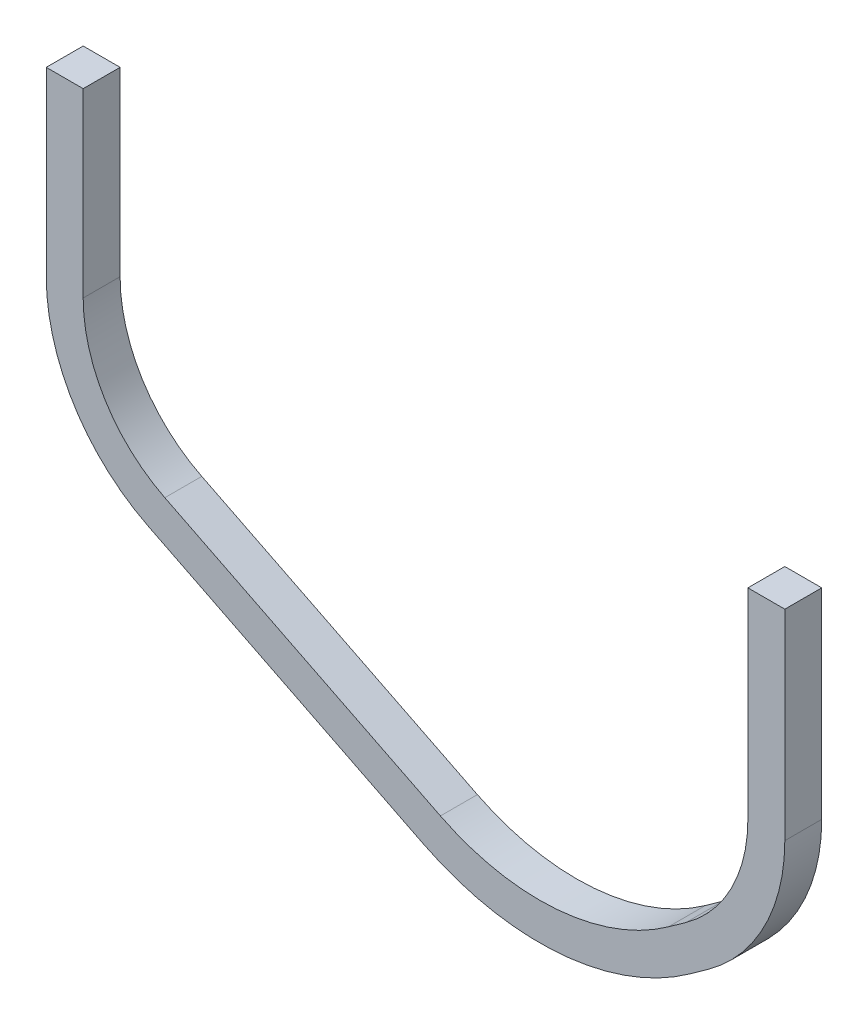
ISO-10303-21;
HEADER;
FILE_DESCRIPTION(('STEP AP214'),'2;1');
FILE_NAME('part.step','',(''),(''),'','','');
FILE_SCHEMA(('AUTOMOTIVE_DESIGN { 1 0 10303 214 1 1 1 1 }'));
ENDSEC;
DATA;
#1=APPLICATION_CONTEXT('core data for automotive mechanical design processes');
#2=APPLICATION_PROTOCOL_DEFINITION('international standard','automotive_design',2000,#1);
#3=PRODUCT_CONTEXT('',#1,'mechanical');
#4=PRODUCT('Part','Part','',(#3));
#5=PRODUCT_RELATED_PRODUCT_CATEGORY('part','',(#4));
#6=PRODUCT_DEFINITION_FORMATION('','',#4);
#7=PRODUCT_DEFINITION_CONTEXT('part definition',#1,'design');
#8=PRODUCT_DEFINITION('design','',#6,#7);
#9=PRODUCT_DEFINITION_SHAPE('','',#8);
#10=(LENGTH_UNIT() NAMED_UNIT(*) SI_UNIT(.MILLI.,.METRE.));
#11=(NAMED_UNIT(*) PLANE_ANGLE_UNIT() SI_UNIT($,.RADIAN.));
#12=(NAMED_UNIT(*) SI_UNIT($,.STERADIAN.) SOLID_ANGLE_UNIT());
#13=UNCERTAINTY_MEASURE_WITH_UNIT(LENGTH_MEASURE(1.E-05),#10,'distance_accuracy_value','');
#14=(GEOMETRIC_REPRESENTATION_CONTEXT(3) GLOBAL_UNCERTAINTY_ASSIGNED_CONTEXT((#13)) GLOBAL_UNIT_ASSIGNED_CONTEXT((#10,
#11,#12)) REPRESENTATION_CONTEXT('',''));
#15=CARTESIAN_POINT('',(0.,0.,0.));
#16=DIRECTION('',(0.,0.,1.));
#17=DIRECTION('',(1.,0.,0.));
#18=AXIS2_PLACEMENT_3D('',#15,#16,#17);
#19=CARTESIAN_POINT('',(-10.,4.00000010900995,0.25));
#20=DIRECTION('',(0.,-1.,0.));
#21=DIRECTION('',(0.,0.,-1.));
#22=AXIS2_PLACEMENT_3D('',#19,#20,#21);
#23=PLANE('',#22);
#24=DIRECTION('',(-1.,0.,0.));
#25=VECTOR('',#24,1.);
#26=CARTESIAN_POINT('',(-10.,4.00000010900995,-0.25));
#27=LINE('',#26,#25);
#28=CARTESIAN_POINT('',(-9.49999999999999,4.00000010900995,-0.25));
#29=VERTEX_POINT('',#28);
#30=CARTESIAN_POINT('',(-10.,4.00000010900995,-0.25));
#31=VERTEX_POINT('',#30);
#32=EDGE_CURVE('E149',#29,#31,#27,.T.);
#33=ORIENTED_EDGE('',*,*,#32,.T.);
#34=DIRECTION('',(0.,0.,-1.));
#35=VECTOR('',#34,1.);
#36=CARTESIAN_POINT('',(-10.,4.00000010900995,0.25));
#37=LINE('',#36,#35);
#38=CARTESIAN_POINT('',(-10.,4.00000010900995,0.25));
#39=VERTEX_POINT('',#38);
#40=EDGE_CURVE('E156',#39,#31,#37,.T.);
#41=ORIENTED_EDGE('',*,*,#40,.F.);
#42=DIRECTION('',(-1.,0.,0.));
#43=VECTOR('',#42,1.);
#44=CARTESIAN_POINT('',(-10.,4.00000010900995,0.25));
#45=LINE('',#44,#43);
#46=CARTESIAN_POINT('',(-9.49999999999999,4.00000010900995,0.25));
#47=VERTEX_POINT('',#46);
#48=EDGE_CURVE('E188',#47,#39,#45,.T.);
#49=ORIENTED_EDGE('',*,*,#48,.F.);
#50=DIRECTION('',(0.,0.,-1.));
#51=VECTOR('',#50,1.);
#52=CARTESIAN_POINT('',(-9.49999999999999,4.00000010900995,0.25));
#53=LINE('',#52,#51);
#54=EDGE_CURVE('E168',#47,#29,#53,.T.);
#55=ORIENTED_EDGE('',*,*,#54,.T.);
#56=EDGE_LOOP('',(#33,#41,#49,#55));
#57=FACE_BOUND('',#56,.T.);
#58=ADVANCED_FACE('F33',(#57),#23,.F.);
#59=CARTESIAN_POINT('',(-10.,4.00000010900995,0.25));
#60=DIRECTION('',(1.,0.,0.));
#61=DIRECTION('',(0.,1.,0.));
#62=AXIS2_PLACEMENT_3D('',#59,#60,#61);
#63=PLANE('',#62);
#64=DIRECTION('',(0.,-1.,0.));
#65=VECTOR('',#64,1.);
#66=CARTESIAN_POINT('',(-10.,4.00000010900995,-0.25));
#67=LINE('',#66,#65);
#68=CARTESIAN_POINT('',(-10.,1.54508505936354,-0.25));
#69=VERTEX_POINT('',#68);
#70=EDGE_CURVE('E144',#31,#69,#67,.T.);
#71=ORIENTED_EDGE('',*,*,#70,.T.);
#72=DIRECTION('',(0.,0.,-1.));
#73=VECTOR('',#72,1.);
#74=CARTESIAN_POINT('',(-10.,1.54508505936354,0.25));
#75=LINE('',#74,#73);
#76=CARTESIAN_POINT('',(-10.,1.54508505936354,0.25));
#77=VERTEX_POINT('',#76);
#78=EDGE_CURVE('E229',#69,#77,#75,.F.);
#79=ORIENTED_EDGE('',*,*,#78,.T.);
#80=DIRECTION('',(0.,-1.,0.));
#81=VECTOR('',#80,1.);
#82=CARTESIAN_POINT('',(-10.,4.00000010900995,0.25));
#83=LINE('',#82,#81);
#84=EDGE_CURVE('E159',#39,#77,#83,.T.);
#85=ORIENTED_EDGE('',*,*,#84,.F.);
#86=ORIENTED_EDGE('',*,*,#40,.T.);
#87=EDGE_LOOP('',(#71,#79,#85,#86));
#88=FACE_BOUND('',#87,.T.);
#89=ADVANCED_FACE('F157',(#88),#63,.F.);
#90=CARTESIAN_POINT('',(-10.,1.09009954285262E-07,0.25));
#91=DIRECTION('',(0.447213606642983,0.894427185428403,0.));
#92=DIRECTION('',(-0.894427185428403,0.447213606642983,0.));
#93=AXIS2_PLACEMENT_3D('',#90,#91,#92);
#94=PLANE('',#93);
#95=DIRECTION('',(0.894427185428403,-0.447213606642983,0.));
#96=VECTOR('',#95,1.);
#97=CARTESIAN_POINT('',(-10.,1.09009954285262E-07,-0.25));
#98=LINE('',#97,#96);
#99=CARTESIAN_POINT('',(-8.61803401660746,-0.690982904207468,-0.25));
#100=VERTEX_POINT('',#99);
#101=CARTESIAN_POINT('',(-4.88657774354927,-2.55671109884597,-0.25));
#102=VERTEX_POINT('',#101);
#103=EDGE_CURVE('E153',#100,#102,#98,.T.);
#104=ORIENTED_EDGE('',*,*,#103,.T.);
#105=DIRECTION('',(0.,0.,-1.));
#106=VECTOR('',#105,1.);
#107=CARTESIAN_POINT('',(-4.88657774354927,-2.55671109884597,0.25));
#108=LINE('',#107,#106);
#109=CARTESIAN_POINT('',(-4.88657774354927,-2.55671109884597,0.25));
#110=VERTEX_POINT('',#109);
#111=EDGE_CURVE('E40',#102,#110,#108,.F.);
#112=ORIENTED_EDGE('',*,*,#111,.T.);
#113=DIRECTION('',(0.894427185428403,-0.447213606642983,0.));
#114=VECTOR('',#113,1.);
#115=CARTESIAN_POINT('',(-10.,1.09009954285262E-07,0.25));
#116=LINE('',#115,#114);
#117=CARTESIAN_POINT('',(-8.61803401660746,-0.690982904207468,0.25));
#118=VERTEX_POINT('',#117);
#119=EDGE_CURVE('E191',#118,#110,#116,.T.);
#120=ORIENTED_EDGE('',*,*,#119,.F.);
#121=DIRECTION('',(0.,0.,-1.));
#122=VECTOR('',#121,1.);
#123=CARTESIAN_POINT('',(-8.61803401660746,-0.690982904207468,0.25));
#124=LINE('',#123,#122);
#125=EDGE_CURVE('E225',#118,#100,#124,.T.);
#126=ORIENTED_EDGE('',*,*,#125,.T.);
#127=EDGE_LOOP('',(#104,#112,#120,#126));
#128=FACE_BOUND('',#127,.T.);
#129=ADVANCED_FACE('F331',(#128),#94,.F.);
#130=CARTESIAN_POINT('',(-3.,-3.5,0.25));
#131=DIRECTION('',(-0.581911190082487,0.81325233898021,0.));
#132=DIRECTION('',(-0.81325233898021,-0.581911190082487,0.));
#133=AXIS2_PLACEMENT_3D('',#130,#131,#132);
#134=PLANE('',#133);
#135=DIRECTION('',(0.81325233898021,0.581911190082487,0.));
#136=VECTOR('',#135,1.);
#137=CARTESIAN_POINT('',(-3.,-3.5,0.25));
#138=LINE('',#137,#136);
#139=CARTESIAN_POINT('',(-1.28464095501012,-2.2725991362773,0.25));
#140=VERTEX_POINT('',#139);
#141=CARTESIAN_POINT('',(-1.04522202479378,-2.10128631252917,0.25));
#142=VERTEX_POINT('',#141);
#143=EDGE_CURVE('E193',#140,#142,#138,.T.);
#144=ORIENTED_EDGE('',*,*,#143,.F.);
#145=DIRECTION('',(0.,0.,-1.));
#146=VECTOR('',#145,1.);
#147=CARTESIAN_POINT('',(-1.28464095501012,-2.2725991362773,0.25));
#148=LINE('',#147,#146);
#149=CARTESIAN_POINT('',(-1.28464095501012,-2.2725991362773,-0.25));
#150=VERTEX_POINT('',#149);
#151=EDGE_CURVE('E262',#140,#150,#148,.T.);
#152=ORIENTED_EDGE('',*,*,#151,.T.);
#153=DIRECTION('',(0.81325233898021,0.581911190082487,0.));
#154=VECTOR('',#153,1.);
#155=CARTESIAN_POINT('',(-3.,-3.5,-0.25));
#156=LINE('',#155,#154);
#157=CARTESIAN_POINT('',(-1.04522202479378,-2.10128631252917,-0.25));
#158=VERTEX_POINT('',#157);
#159=EDGE_CURVE('E172',#150,#158,#156,.T.);
#160=ORIENTED_EDGE('',*,*,#159,.T.);
#161=DIRECTION('',(0.,0.,-1.));
#162=VECTOR('',#161,1.);
#163=CARTESIAN_POINT('',(-1.04522202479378,-2.10128631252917,0.25));
#164=LINE('',#163,#162);
#165=EDGE_CURVE('E239',#158,#142,#164,.F.);
#166=ORIENTED_EDGE('',*,*,#165,.T.);
#167=EDGE_LOOP('',(#144,#152,#160,#166));
#168=FACE_BOUND('',#167,.T.);
#169=ADVANCED_FACE('F268',(#168),#134,.F.);
#170=CARTESIAN_POINT('',(0.,-1.3533925,0.25));
#171=DIRECTION('',(-1.,0.,0.));
#172=DIRECTION('',(0.,0.,1.));
#173=AXIS2_PLACEMENT_3D('',#170,#171,#172);
#174=PLANE('',#173);
#175=DIRECTION('',(0.,1.,0.));
#176=VECTOR('',#175,1.);
#177=CARTESIAN_POINT('',(0.,-1.3533925,0.25));
#178=LINE('',#177,#176);
#179=CARTESIAN_POINT('',(0.,-0.0681554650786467,0.25));
#180=VERTEX_POINT('',#179);
#181=CARTESIAN_POINT('',(0.,2.6466075,0.25));
#182=VERTEX_POINT('',#181);
#183=EDGE_CURVE('E195',#180,#182,#178,.T.);
#184=ORIENTED_EDGE('',*,*,#183,.F.);
#185=DIRECTION('',(0.,0.,-1.));
#186=VECTOR('',#185,1.);
#187=CARTESIAN_POINT('',(0.,-0.0681554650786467,0.25));
#188=LINE('',#187,#186);
#189=CARTESIAN_POINT('',(0.,-0.0681554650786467,-0.25));
#190=VERTEX_POINT('',#189);
#191=EDGE_CURVE('E233',#180,#190,#188,.T.);
#192=ORIENTED_EDGE('',*,*,#191,.T.);
#193=DIRECTION('',(0.,1.,0.));
#194=VECTOR('',#193,1.);
#195=CARTESIAN_POINT('',(0.,-1.3533925,-0.25));
#196=LINE('',#195,#194);
#197=CARTESIAN_POINT('',(0.,2.6466075,-0.25));
#198=VERTEX_POINT('',#197);
#199=EDGE_CURVE('E174',#190,#198,#196,.T.);
#200=ORIENTED_EDGE('',*,*,#199,.T.);
#201=DIRECTION('',(0.,0.,-1.));
#202=VECTOR('',#201,1.);
#203=CARTESIAN_POINT('',(0.,2.6466075,0.25));
#204=LINE('',#203,#202);
#205=EDGE_CURVE('E164',#182,#198,#204,.T.);
#206=ORIENTED_EDGE('',*,*,#205,.F.);
#207=EDGE_LOOP('',(#184,#192,#200,#206));
#208=FACE_BOUND('',#207,.T.);
#209=ADVANCED_FACE('F283',(#208),#174,.F.);
#210=CARTESIAN_POINT('',(-0.5,2.6466075,0.25));
#211=DIRECTION('',(0.,-1.,0.));
#212=DIRECTION('',(1.,0.,0.));
#213=AXIS2_PLACEMENT_3D('',#210,#211,#212);
#214=PLANE('',#213);
#215=DIRECTION('',(-1.,0.,0.));
#216=VECTOR('',#215,1.);
#217=CARTESIAN_POINT('',(-0.5,2.6466075,-0.25));
#218=LINE('',#217,#216);
#219=CARTESIAN_POINT('',(-0.5,2.6466075,-0.25));
#220=VERTEX_POINT('',#219);
#221=EDGE_CURVE('E176',#198,#220,#218,.T.);
#222=ORIENTED_EDGE('',*,*,#221,.T.);
#223=DIRECTION('',(0.,0.,-1.));
#224=VECTOR('',#223,1.);
#225=CARTESIAN_POINT('',(-0.5,2.6466075,0.25));
#226=LINE('',#225,#224);
#227=CARTESIAN_POINT('',(-0.5,2.6466075,0.25));
#228=VERTEX_POINT('',#227);
#229=EDGE_CURVE('E210',#228,#220,#226,.T.);
#230=ORIENTED_EDGE('',*,*,#229,.F.);
#231=DIRECTION('',(-1.,0.,0.));
#232=VECTOR('',#231,1.);
#233=CARTESIAN_POINT('',(-0.5,2.6466075,0.25));
#234=LINE('',#233,#232);
#235=EDGE_CURVE('E197',#182,#228,#234,.T.);
#236=ORIENTED_EDGE('',*,*,#235,.F.);
#237=ORIENTED_EDGE('',*,*,#205,.T.);
#238=EDGE_LOOP('',(#222,#230,#236,#237));
#239=FACE_BOUND('',#238,.T.);
#240=ADVANCED_FACE('F287',(#239),#214,.F.);
#241=CARTESIAN_POINT('',(-0.5,-1.09634509,0.25));
#242=DIRECTION('',(1.,0.,0.));
#243=DIRECTION('',(0.,0.,-1.));
#244=AXIS2_PLACEMENT_3D('',#241,#242,#243);
#245=PLANE('',#244);
#246=DIRECTION('',(0.,-1.,0.));
#247=VECTOR('',#246,1.);
#248=CARTESIAN_POINT('',(-0.5,-1.09634509,-0.25));
#249=LINE('',#248,#247);
#250=CARTESIAN_POINT('',(-0.5,-0.0681554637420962,-0.25));
#251=VERTEX_POINT('',#250);
#252=EDGE_CURVE('E178',#220,#251,#249,.T.);
#253=ORIENTED_EDGE('',*,*,#252,.T.);
#254=DIRECTION('',(0.,0.,-1.));
#255=VECTOR('',#254,1.);
#256=CARTESIAN_POINT('',(-0.5,-0.0681554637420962,0.25));
#257=LINE('',#256,#255);
#258=CARTESIAN_POINT('',(-0.5,-0.0681554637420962,0.25));
#259=VERTEX_POINT('',#258);
#260=EDGE_CURVE('E247',#251,#259,#257,.F.);
#261=ORIENTED_EDGE('',*,*,#260,.T.);
#262=DIRECTION('',(0.,-1.,0.));
#263=VECTOR('',#262,1.);
#264=CARTESIAN_POINT('',(-0.5,-1.09634509,0.25));
#265=LINE('',#264,#263);
#266=EDGE_CURVE('E199',#228,#259,#265,.T.);
#267=ORIENTED_EDGE('',*,*,#266,.F.);
#268=ORIENTED_EDGE('',*,*,#229,.T.);
#269=EDGE_LOOP('',(#253,#261,#267,#268));
#270=FACE_BOUND('',#269,.T.);
#271=ADVANCED_FACE('F343',(#270),#245,.F.);
#272=CARTESIAN_POINT('',(-3.04590429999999,-2.91803085,0.25));
#273=DIRECTION('',(0.581911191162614,-0.813252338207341,0.));
#274=DIRECTION('',(0.813252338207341,0.581911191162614,0.));
#275=AXIS2_PLACEMENT_3D('',#272,#273,#274);
#276=PLANE('',#275);
#277=DIRECTION('',(-0.813252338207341,-0.581911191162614,0.));
#278=VECTOR('',#277,1.);
#279=CARTESIAN_POINT('',(-3.04590429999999,-2.91803085,-0.25));
#280=LINE('',#279,#278);
#281=CARTESIAN_POINT('',(-1.33617761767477,-1.69466014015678,-0.25));
#282=VERTEX_POINT('',#281);
#283=CARTESIAN_POINT('',(-1.57559654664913,-1.86597296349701,-0.25));
#284=VERTEX_POINT('',#283);
#285=EDGE_CURVE('E181',#282,#284,#280,.T.);
#286=ORIENTED_EDGE('',*,*,#285,.T.);
#287=DIRECTION('',(0.,0.,-1.));
#288=VECTOR('',#287,1.);
#289=CARTESIAN_POINT('',(-1.57559654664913,-1.86597296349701,0.25));
#290=LINE('',#289,#288);
#291=CARTESIAN_POINT('',(-1.57559654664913,-1.86597296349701,0.25));
#292=VERTEX_POINT('',#291);
#293=EDGE_CURVE('E256',#284,#292,#290,.F.);
#294=ORIENTED_EDGE('',*,*,#293,.T.);
#295=DIRECTION('',(-0.813252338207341,-0.581911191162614,0.));
#296=VECTOR('',#295,1.);
#297=CARTESIAN_POINT('',(-3.04590429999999,-2.91803085,0.25));
#298=LINE('',#297,#296);
#299=CARTESIAN_POINT('',(-1.33617761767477,-1.69466014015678,0.25));
#300=VERTEX_POINT('',#299);
#301=EDGE_CURVE('E202',#300,#292,#298,.T.);
#302=ORIENTED_EDGE('',*,*,#301,.F.);
#303=DIRECTION('',(0.,0.,-1.));
#304=VECTOR('',#303,1.);
#305=CARTESIAN_POINT('',(-1.33617761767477,-1.69466014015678,-0.25));
#306=LINE('',#305,#304);
#307=EDGE_CURVE('E244',#300,#282,#306,.T.);
#308=ORIENTED_EDGE('',*,*,#307,.T.);
#309=EDGE_LOOP('',(#286,#294,#302,#308));
#310=FACE_BOUND('',#309,.T.);
#311=ADVANCED_FACE('F298',(#310),#276,.F.);
#312=CARTESIAN_POINT('',(-9.49999999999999,0.309017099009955,0.25));
#313=DIRECTION('',(-0.447213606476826,-0.894427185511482,0.));
#314=DIRECTION('',(0.894427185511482,-0.447213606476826,0.));
#315=AXIS2_PLACEMENT_3D('',#312,#313,#314);
#316=PLANE('',#315);
#317=DIRECTION('',(-0.894427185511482,0.447213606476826,0.));
#318=VECTOR('',#317,1.);
#319=CARTESIAN_POINT('',(-9.49999999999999,0.309017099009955,0.25));
#320=LINE('',#319,#318);
#321=CARTESIAN_POINT('',(-4.66297093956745,-2.10949750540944,0.25));
#322=VERTEX_POINT('',#321);
#323=CARTESIAN_POINT('',(-8.39442721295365,-0.243769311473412,0.25));
#324=VERTEX_POINT('',#323);
#325=EDGE_CURVE('E205',#322,#324,#320,.T.);
#326=ORIENTED_EDGE('',*,*,#325,.F.);
#327=DIRECTION('',(0.,0.,-1.));
#328=VECTOR('',#327,1.);
#329=CARTESIAN_POINT('',(-4.66297093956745,-2.10949750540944,-0.25));
#330=LINE('',#329,#328);
#331=CARTESIAN_POINT('',(-4.66297093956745,-2.10949750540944,-0.25));
#332=VERTEX_POINT('',#331);
#333=EDGE_CURVE('E253',#322,#332,#330,.T.);
#334=ORIENTED_EDGE('',*,*,#333,.T.);
#335=DIRECTION('',(-0.894427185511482,0.447213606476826,0.));
#336=VECTOR('',#335,1.);
#337=CARTESIAN_POINT('',(-9.49999999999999,0.309017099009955,-0.25));
#338=LINE('',#337,#336);
#339=CARTESIAN_POINT('',(-8.39442721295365,-0.243769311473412,-0.25));
#340=VERTEX_POINT('',#339);
#341=EDGE_CURVE('E184',#332,#340,#338,.T.);
#342=ORIENTED_EDGE('',*,*,#341,.T.);
#343=DIRECTION('',(0.,0.,-1.));
#344=VECTOR('',#343,1.);
#345=CARTESIAN_POINT('',(-8.39442721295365,-0.243769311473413,0.25));
#346=LINE('',#345,#344);
#347=EDGE_CURVE('E217',#340,#324,#346,.F.);
#348=ORIENTED_EDGE('',*,*,#347,.T.);
#349=EDGE_LOOP('',(#326,#334,#342,#348));
#350=FACE_BOUND('',#349,.T.);
#351=ADVANCED_FACE('F308',(#350),#316,.F.);
#352=CARTESIAN_POINT('',(-9.49999999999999,4.00000010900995,0.25));
#353=DIRECTION('',(-1.,0.,0.));
#354=DIRECTION('',(0.,0.,1.));
#355=AXIS2_PLACEMENT_3D('',#352,#353,#354);
#356=PLANE('',#355);
#357=DIRECTION('',(0.,1.,0.));
#358=VECTOR('',#357,1.);
#359=CARTESIAN_POINT('',(-9.49999999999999,4.00000010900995,0.25));
#360=LINE('',#359,#358);
#361=CARTESIAN_POINT('',(-9.49999999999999,1.54508505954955,0.25));
#362=VERTEX_POINT('',#361);
#363=EDGE_CURVE('E207',#362,#47,#360,.T.);
#364=ORIENTED_EDGE('',*,*,#363,.F.);
#365=DIRECTION('',(0.,0.,-1.));
#366=VECTOR('',#365,1.);
#367=CARTESIAN_POINT('',(-9.49999999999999,1.54508505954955,-0.25));
#368=LINE('',#367,#366);
#369=CARTESIAN_POINT('',(-9.49999999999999,1.54508505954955,-0.25));
#370=VERTEX_POINT('',#369);
#371=EDGE_CURVE('E163',#362,#370,#368,.T.);
#372=ORIENTED_EDGE('',*,*,#371,.T.);
#373=DIRECTION('',(0.,1.,0.));
#374=VECTOR('',#373,1.);
#375=CARTESIAN_POINT('',(-9.49999999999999,4.00000010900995,-0.25));
#376=LINE('',#375,#374);
#377=EDGE_CURVE('E186',#370,#29,#376,.T.);
#378=ORIENTED_EDGE('',*,*,#377,.T.);
#379=ORIENTED_EDGE('',*,*,#54,.F.);
#380=EDGE_LOOP('',(#364,#372,#378,#379));
#381=FACE_BOUND('',#380,.T.);
#382=ADVANCED_FACE('F315',(#381),#356,.F.);
#383=CARTESIAN_POINT('',(-9.49999999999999,4.00000010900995,0.25));
#384=DIRECTION('',(0.,0.,-1.));
#385=DIRECTION('',(-1.,0.,0.));
#386=AXIS2_PLACEMENT_3D('',#383,#384,#385);
#387=PLANE('',#386);
#388=ORIENTED_EDGE('',*,*,#119,.T.);
#389=CARTESIAN_POINT('',(-3.32133012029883,0.573784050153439,0.25));
#390=DIRECTION('',(0.,0.,-1.));
#391=DIRECTION('',(-1.,0.,0.));
#392=AXIS2_PLACEMENT_3D('',#389,#390,#391);
#393=CIRCLE('',#392,3.5);
#394=EDGE_CURVE('E11',#110,#140,#393,.F.);
#395=ORIENTED_EDGE('',*,*,#394,.T.);
#396=ORIENTED_EDGE('',*,*,#143,.T.);
#397=CARTESIAN_POINT('',(-2.5,-0.0681554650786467,0.25));
#398=DIRECTION('',(0.,0.,-1.));
#399=DIRECTION('',(-1.,0.,0.));
#400=AXIS2_PLACEMENT_3D('',#397,#398,#399);
#401=CIRCLE('',#400,2.5);
#402=EDGE_CURVE('E242',#142,#180,#401,.F.);
#403=ORIENTED_EDGE('',*,*,#402,.T.);
#404=ORIENTED_EDGE('',*,*,#183,.T.);
#405=ORIENTED_EDGE('',*,*,#235,.T.);
#406=ORIENTED_EDGE('',*,*,#266,.T.);
#407=CARTESIAN_POINT('',(-2.5,-0.0681554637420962,0.25));
#408=DIRECTION('',(0.,0.,-1.));
#409=DIRECTION('',(-1.,0.,0.));
#410=AXIS2_PLACEMENT_3D('',#407,#408,#409);
#411=CIRCLE('',#410,2.);
#412=EDGE_CURVE('E251',#259,#300,#411,.T.);
#413=ORIENTED_EDGE('',*,*,#412,.T.);
#414=ORIENTED_EDGE('',*,*,#301,.T.);
#415=CARTESIAN_POINT('',(-3.32133012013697,0.573784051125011,0.25));
#416=DIRECTION('',(0.,0.,-1.));
#417=DIRECTION('',(-1.,0.,0.));
#418=AXIS2_PLACEMENT_3D('',#415,#416,#417);
#419=CIRCLE('',#418,3.);
#420=EDGE_CURVE('E260',#292,#322,#419,.T.);
#421=ORIENTED_EDGE('',*,*,#420,.T.);
#422=ORIENTED_EDGE('',*,*,#325,.T.);
#423=CARTESIAN_POINT('',(-7.49999999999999,1.54508505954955,0.25));
#424=DIRECTION('',(0.,0.,-1.));
#425=DIRECTION('',(-1.,0.,0.));
#426=AXIS2_PLACEMENT_3D('',#423,#424,#425);
#427=CIRCLE('',#426,2.);
#428=EDGE_CURVE('E223',#324,#362,#427,.T.);
#429=ORIENTED_EDGE('',*,*,#428,.T.);
#430=ORIENTED_EDGE('',*,*,#363,.T.);
#431=ORIENTED_EDGE('',*,*,#48,.T.);
#432=ORIENTED_EDGE('',*,*,#84,.T.);
#433=CARTESIAN_POINT('',(-7.5,1.54508505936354,0.25));
#434=DIRECTION('',(0.,0.,-1.));
#435=DIRECTION('',(-1.,0.,0.));
#436=AXIS2_PLACEMENT_3D('',#433,#434,#435);
#437=CIRCLE('',#436,2.5);
#438=EDGE_CURVE('E231',#77,#118,#437,.F.);
#439=ORIENTED_EDGE('',*,*,#438,.T.);
#440=EDGE_LOOP('',(#388,#395,#396,#403,#404,#405,#406,#413,#414,#421,#422,#429,#430,#431,#432,#439));
#441=FACE_BOUND('',#440,.T.);
#442=ADVANCED_FACE('F280',(#441),#387,.F.);
#443=CARTESIAN_POINT('',(-9.49999999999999,4.00000010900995,-0.25));
#444=DIRECTION('',(0.,0.,-1.));
#445=DIRECTION('',(-1.,0.,0.));
#446=AXIS2_PLACEMENT_3D('',#443,#444,#445);
#447=PLANE('',#446);
#448=ORIENTED_EDGE('',*,*,#159,.F.);
#449=CARTESIAN_POINT('',(-3.32133012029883,0.573784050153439,-0.25));
#450=DIRECTION('',(0.,0.,-1.));
#451=DIRECTION('',(-1.,0.,0.));
#452=AXIS2_PLACEMENT_3D('',#449,#450,#451);
#453=CIRCLE('',#452,3.5);
#454=EDGE_CURVE('E54',#150,#102,#453,.T.);
#455=ORIENTED_EDGE('',*,*,#454,.T.);
#456=ORIENTED_EDGE('',*,*,#103,.F.);
#457=CARTESIAN_POINT('',(-7.5,1.54508505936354,-0.25));
#458=DIRECTION('',(0.,0.,-1.));
#459=DIRECTION('',(-1.,0.,0.));
#460=AXIS2_PLACEMENT_3D('',#457,#458,#459);
#461=CIRCLE('',#460,2.5);
#462=EDGE_CURVE('E150',#100,#69,#461,.T.);
#463=ORIENTED_EDGE('',*,*,#462,.T.);
#464=ORIENTED_EDGE('',*,*,#70,.F.);
#465=ORIENTED_EDGE('',*,*,#32,.F.);
#466=ORIENTED_EDGE('',*,*,#377,.F.);
#467=CARTESIAN_POINT('',(-7.49999999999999,1.54508505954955,-0.25));
#468=DIRECTION('',(0.,0.,-1.));
#469=DIRECTION('',(-1.,0.,0.));
#470=AXIS2_PLACEMENT_3D('',#467,#468,#469);
#471=CIRCLE('',#470,2.);
#472=EDGE_CURVE('E220',#370,#340,#471,.F.);
#473=ORIENTED_EDGE('',*,*,#472,.T.);
#474=ORIENTED_EDGE('',*,*,#341,.F.);
#475=CARTESIAN_POINT('',(-3.32133012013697,0.573784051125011,-0.25));
#476=DIRECTION('',(0.,0.,-1.));
#477=DIRECTION('',(-1.,0.,0.));
#478=AXIS2_PLACEMENT_3D('',#475,#476,#477);
#479=CIRCLE('',#478,3.);
#480=EDGE_CURVE('E258',#332,#284,#479,.F.);
#481=ORIENTED_EDGE('',*,*,#480,.T.);
#482=ORIENTED_EDGE('',*,*,#285,.F.);
#483=CARTESIAN_POINT('',(-2.5,-0.0681554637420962,-0.25));
#484=DIRECTION('',(0.,0.,-1.));
#485=DIRECTION('',(-1.,0.,0.));
#486=AXIS2_PLACEMENT_3D('',#483,#484,#485);
#487=CIRCLE('',#486,2.);
#488=EDGE_CURVE('E249',#282,#251,#487,.F.);
#489=ORIENTED_EDGE('',*,*,#488,.T.);
#490=ORIENTED_EDGE('',*,*,#252,.F.);
#491=ORIENTED_EDGE('',*,*,#221,.F.);
#492=ORIENTED_EDGE('',*,*,#199,.F.);
#493=CARTESIAN_POINT('',(-2.5,-0.0681554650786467,-0.25));
#494=DIRECTION('',(0.,0.,-1.));
#495=DIRECTION('',(-1.,0.,0.));
#496=AXIS2_PLACEMENT_3D('',#493,#494,#495);
#497=CIRCLE('',#496,2.5);
#498=EDGE_CURVE('E236',#190,#158,#497,.T.);
#499=ORIENTED_EDGE('',*,*,#498,.T.);
#500=EDGE_LOOP('',(#448,#455,#456,#463,#464,#465,#466,#473,#474,#481,#482,#489,#490,#491,#492,#499));
#501=FACE_BOUND('',#500,.T.);
#502=ADVANCED_FACE('F146',(#501),#447,.T.);
#503=CARTESIAN_POINT('',(-7.49999999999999,1.54508505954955,0.25));
#504=DIRECTION('',(0.,0.,1.));
#505=DIRECTION('',(1.,0.,0.));
#506=AXIS2_PLACEMENT_3D('',#503,#504,#505);
#507=CYLINDRICAL_SURFACE('',#506,2.);
#508=ORIENTED_EDGE('',*,*,#428,.F.);
#509=ORIENTED_EDGE('',*,*,#347,.F.);
#510=ORIENTED_EDGE('',*,*,#472,.F.);
#511=ORIENTED_EDGE('',*,*,#371,.F.);
#512=EDGE_LOOP('',(#508,#509,#510,#511));
#513=FACE_BOUND('',#512,.T.);
#514=ADVANCED_FACE('F316',(#513),#507,.F.);
#515=CARTESIAN_POINT('',(-7.5,1.54508505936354,0.25));
#516=DIRECTION('',(0.,0.,-1.));
#517=DIRECTION('',(-1.,0.,0.));
#518=AXIS2_PLACEMENT_3D('',#515,#516,#517);
#519=CYLINDRICAL_SURFACE('',#518,2.5);
#520=ORIENTED_EDGE('',*,*,#438,.F.);
#521=ORIENTED_EDGE('',*,*,#78,.F.);
#522=ORIENTED_EDGE('',*,*,#462,.F.);
#523=ORIENTED_EDGE('',*,*,#125,.F.);
#524=EDGE_LOOP('',(#520,#521,#522,#523));
#525=FACE_BOUND('',#524,.T.);
#526=ADVANCED_FACE('F318',(#525),#519,.T.);
#527=CARTESIAN_POINT('',(-2.5,-0.0681554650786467,0.25));
#528=DIRECTION('',(0.,0.,-1.));
#529=DIRECTION('',(-1.,0.,0.));
#530=AXIS2_PLACEMENT_3D('',#527,#528,#529);
#531=CYLINDRICAL_SURFACE('',#530,2.5);
#532=ORIENTED_EDGE('',*,*,#402,.F.);
#533=ORIENTED_EDGE('',*,*,#165,.F.);
#534=ORIENTED_EDGE('',*,*,#498,.F.);
#535=ORIENTED_EDGE('',*,*,#191,.F.);
#536=EDGE_LOOP('',(#532,#533,#534,#535));
#537=FACE_BOUND('',#536,.T.);
#538=ADVANCED_FACE('F277',(#537),#531,.T.);
#539=CARTESIAN_POINT('',(-2.5,-0.0681554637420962,0.25));
#540=DIRECTION('',(0.,0.,1.));
#541=DIRECTION('',(1.,0.,0.));
#542=AXIS2_PLACEMENT_3D('',#539,#540,#541);
#543=CYLINDRICAL_SURFACE('',#542,2.);
#544=ORIENTED_EDGE('',*,*,#412,.F.);
#545=ORIENTED_EDGE('',*,*,#260,.F.);
#546=ORIENTED_EDGE('',*,*,#488,.F.);
#547=ORIENTED_EDGE('',*,*,#307,.F.);
#548=EDGE_LOOP('',(#544,#545,#546,#547));
#549=FACE_BOUND('',#548,.T.);
#550=ADVANCED_FACE('F295',(#549),#543,.F.);
#551=CARTESIAN_POINT('',(-3.32133012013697,0.573784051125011,0.25));
#552=DIRECTION('',(0.,0.,1.));
#553=DIRECTION('',(1.,0.,0.));
#554=AXIS2_PLACEMENT_3D('',#551,#552,#553);
#555=CYLINDRICAL_SURFACE('',#554,3.);
#556=ORIENTED_EDGE('',*,*,#420,.F.);
#557=ORIENTED_EDGE('',*,*,#293,.F.);
#558=ORIENTED_EDGE('',*,*,#480,.F.);
#559=ORIENTED_EDGE('',*,*,#333,.F.);
#560=EDGE_LOOP('',(#556,#557,#558,#559));
#561=FACE_BOUND('',#560,.T.);
#562=ADVANCED_FACE('F305',(#561),#555,.F.);
#563=CARTESIAN_POINT('',(-3.32133012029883,0.573784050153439,0.25));
#564=DIRECTION('',(0.,0.,-1.));
#565=DIRECTION('',(-1.,0.,0.));
#566=AXIS2_PLACEMENT_3D('',#563,#564,#565);
#567=CYLINDRICAL_SURFACE('',#566,3.5);
#568=ORIENTED_EDGE('',*,*,#394,.F.);
#569=ORIENTED_EDGE('',*,*,#111,.F.);
#570=ORIENTED_EDGE('',*,*,#454,.F.);
#571=ORIENTED_EDGE('',*,*,#151,.F.);
#572=EDGE_LOOP('',(#568,#569,#570,#571));
#573=FACE_BOUND('',#572,.T.);
#574=ADVANCED_FACE('F368',(#573),#567,.T.);
#575=CLOSED_SHELL('',(#58,#89,#129,#169,#209,#240,#271,#311,#351,#382,#442,#502,#514,#526,#538,
#550,#562,#574));
#576=MANIFOLD_SOLID_BREP('B2',#575);
#577=ADVANCED_BREP_SHAPE_REPRESENTATION('',(#18,#576),#14);
#578=SHAPE_DEFINITION_REPRESENTATION(#9,#577);
ENDSEC;
END-ISO-10303-21;
